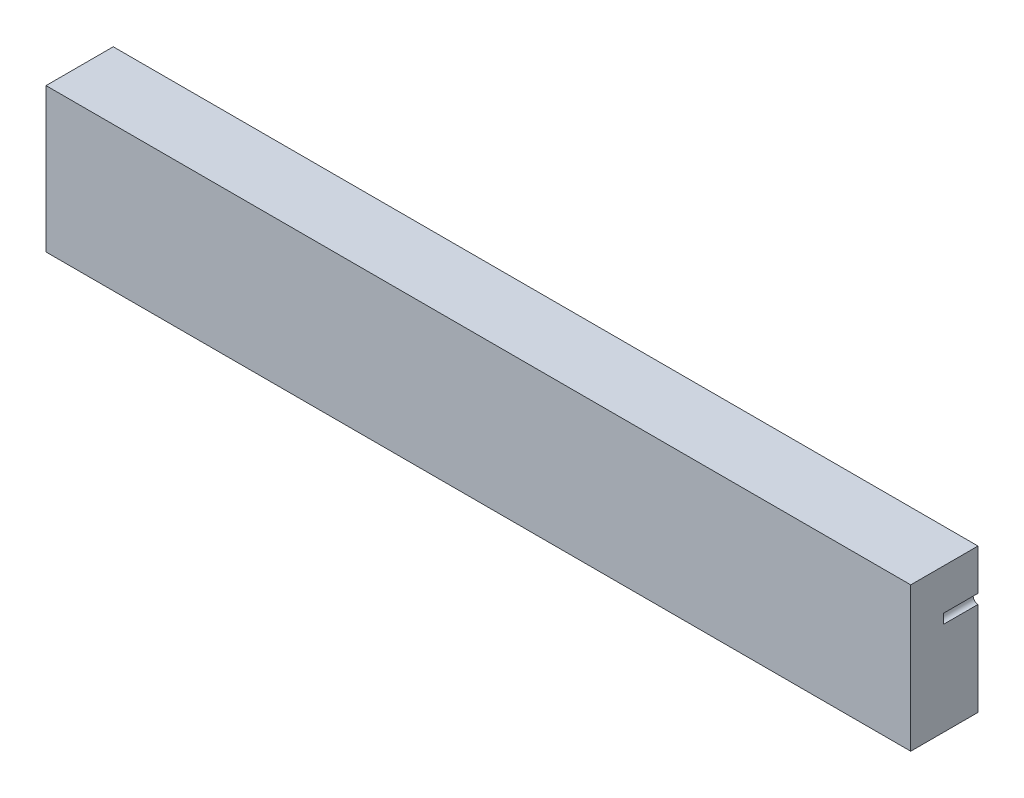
ISO-10303-21;
HEADER;
FILE_DESCRIPTION(('STEP AP214'),'2;1');
FILE_NAME('part.step','',(''),(''),'','','');
FILE_SCHEMA(('AUTOMOTIVE_DESIGN { 1 0 10303 214 1 1 1 1 }'));
ENDSEC;
DATA;
#1=APPLICATION_CONTEXT('core data for automotive mechanical design processes');
#2=APPLICATION_PROTOCOL_DEFINITION('international standard','automotive_design',2000,#1);
#3=PRODUCT_CONTEXT('',#1,'mechanical');
#4=PRODUCT('Part','Part','',(#3));
#5=PRODUCT_RELATED_PRODUCT_CATEGORY('part','',(#4));
#6=PRODUCT_DEFINITION_FORMATION('','',#4);
#7=PRODUCT_DEFINITION_CONTEXT('part definition',#1,'design');
#8=PRODUCT_DEFINITION('design','',#6,#7);
#9=PRODUCT_DEFINITION_SHAPE('','',#8);
#10=(LENGTH_UNIT() NAMED_UNIT(*) SI_UNIT(.MILLI.,.METRE.));
#11=(NAMED_UNIT(*) PLANE_ANGLE_UNIT() SI_UNIT($,.RADIAN.));
#12=(NAMED_UNIT(*) SI_UNIT($,.STERADIAN.) SOLID_ANGLE_UNIT());
#13=UNCERTAINTY_MEASURE_WITH_UNIT(LENGTH_MEASURE(1.E-05),#10,'distance_accuracy_value','');
#14=(GEOMETRIC_REPRESENTATION_CONTEXT(3) GLOBAL_UNCERTAINTY_ASSIGNED_CONTEXT((#13)) GLOBAL_UNIT_ASSIGNED_CONTEXT((#10,
#11,#12)) REPRESENTATION_CONTEXT('',''));
#15=CARTESIAN_POINT('',(0.,0.,0.));
#16=DIRECTION('',(0.,0.,1.));
#17=DIRECTION('',(1.,0.,0.));
#18=AXIS2_PLACEMENT_3D('',#15,#16,#17);
#19=CARTESIAN_POINT('',(285.606602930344,566.490907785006,12.7));
#20=DIRECTION('',(0.,0.,-1.));
#21=DIRECTION('',(-1.,0.,0.));
#22=AXIS2_PLACEMENT_3D('',#19,#20,#21);
#23=PLANE('',#22);
#24=CARTESIAN_POINT('',(285.606602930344,566.490907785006,12.7));
#25=DIRECTION('',(0.,0.,-1.));
#26=DIRECTION('',(-1.,0.,0.));
#27=AXIS2_PLACEMENT_3D('',#24,#25,#26);
#28=CIRCLE('',#27,1.26999999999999);
#29=CARTESIAN_POINT('',(284.336602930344,566.490907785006,12.7));
#30=VERTEX_POINT('',#29);
#31=EDGE_CURVE('E20',#30,#30,#28,.T.);
#32=ORIENTED_EDGE('',*,*,#31,.T.);
#33=EDGE_LOOP('',(#32));
#34=FACE_BOUND('',#33,.T.);
#35=ADVANCED_FACE('F17',(#34),#23,.T.);
#36=CARTESIAN_POINT('',(256.970581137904,566.490907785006,12.7));
#37=DIRECTION('',(0.,0.,1.));
#38=DIRECTION('',(1.,0.,0.));
#39=AXIS2_PLACEMENT_3D('',#36,#37,#38);
#40=PLANE('',#39);
#41=CARTESIAN_POINT('',(256.970581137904,566.490907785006,12.7));
#42=DIRECTION('',(0.,0.,-1.));
#43=DIRECTION('',(-1.,0.,0.));
#44=AXIS2_PLACEMENT_3D('',#41,#42,#43);
#45=CIRCLE('',#44,1.26999999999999);
#46=CARTESIAN_POINT('',(255.700581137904,566.490907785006,12.7));
#47=VERTEX_POINT('',#46);
#48=EDGE_CURVE('E171',#47,#47,#45,.T.);
#49=ORIENTED_EDGE('',*,*,#48,.T.);
#50=EDGE_LOOP('',(#49));
#51=FACE_BOUND('',#50,.T.);
#52=ADVANCED_FACE('F248',(#51),#40,.F.);
#53=CARTESIAN_POINT('',(341.409278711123,566.490907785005,12.7));
#54=DIRECTION('',(0.,0.,-1.));
#55=DIRECTION('',(-1.,0.,0.));
#56=AXIS2_PLACEMENT_3D('',#53,#54,#55);
#57=PLANE('',#56);
#58=CARTESIAN_POINT('',(341.409278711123,566.490907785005,12.7));
#59=DIRECTION('',(0.,0.,-1.));
#60=DIRECTION('',(-1.,0.,0.));
#61=AXIS2_PLACEMENT_3D('',#58,#59,#60);
#62=CIRCLE('',#61,1.26999999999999);
#63=CARTESIAN_POINT('',(340.139278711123,566.490907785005,12.7));
#64=VERTEX_POINT('',#63);
#65=EDGE_CURVE('E169',#64,#64,#62,.T.);
#66=ORIENTED_EDGE('',*,*,#65,.T.);
#67=EDGE_LOOP('',(#66));
#68=FACE_BOUND('',#67,.T.);
#69=ADVANCED_FACE('F245',(#68),#57,.T.);
#70=CARTESIAN_POINT('',(312.773256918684,566.490907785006,12.7));
#71=DIRECTION('',(0.,0.,1.));
#72=DIRECTION('',(1.,0.,0.));
#73=AXIS2_PLACEMENT_3D('',#70,#71,#72);
#74=PLANE('',#73);
#75=CARTESIAN_POINT('',(312.773256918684,566.490907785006,12.7));
#76=DIRECTION('',(0.,0.,-1.));
#77=DIRECTION('',(-1.,0.,0.));
#78=AXIS2_PLACEMENT_3D('',#75,#76,#77);
#79=CIRCLE('',#78,1.26999999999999);
#80=CARTESIAN_POINT('',(311.503256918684,566.490907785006,12.7));
#81=VERTEX_POINT('',#80);
#82=EDGE_CURVE('E166',#81,#81,#79,.T.);
#83=ORIENTED_EDGE('',*,*,#82,.T.);
#84=EDGE_LOOP('',(#83));
#85=FACE_BOUND('',#84,.T.);
#86=ADVANCED_FACE('F247',(#85),#74,.F.);
#87=CARTESIAN_POINT('',(237.255677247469,566.112211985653,12.7));
#88=DIRECTION('',(0.,0.,1.));
#89=DIRECTION('',(1.,0.,0.));
#90=AXIS2_PLACEMENT_3D('',#87,#88,#89);
#91=PLANE('',#90);
#92=CARTESIAN_POINT('',(237.255677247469,566.112211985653,12.7));
#93=DIRECTION('',(0.,0.,-1.));
#94=DIRECTION('',(-1.,0.,0.));
#95=AXIS2_PLACEMENT_3D('',#92,#93,#94);
#96=CIRCLE('',#95,1.26999999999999);
#97=CARTESIAN_POINT('',(235.985677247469,566.112211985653,12.7));
#98=VERTEX_POINT('',#97);
#99=EDGE_CURVE('E163',#98,#98,#96,.T.);
#100=ORIENTED_EDGE('',*,*,#99,.T.);
#101=EDGE_LOOP('',(#100));
#102=FACE_BOUND('',#101,.T.);
#103=ADVANCED_FACE('F193',(#102),#91,.F.);
#104=CARTESIAN_POINT('',(360.901203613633,566.112211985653,12.7));
#105=DIRECTION('',(0.,0.,1.));
#106=DIRECTION('',(1.,0.,0.));
#107=AXIS2_PLACEMENT_3D('',#104,#105,#106);
#108=PLANE('',#107);
#109=CARTESIAN_POINT('',(360.901203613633,566.112211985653,12.7));
#110=DIRECTION('',(0.,0.,-1.));
#111=DIRECTION('',(-1.,0.,0.));
#112=AXIS2_PLACEMENT_3D('',#109,#110,#111);
#113=CIRCLE('',#112,1.26999999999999);
#114=CARTESIAN_POINT('',(359.631203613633,566.112211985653,12.7));
#115=VERTEX_POINT('',#114);
#116=EDGE_CURVE('E79',#115,#115,#113,.T.);
#117=ORIENTED_EDGE('',*,*,#116,.T.);
#118=EDGE_LOOP('',(#117));
#119=FACE_BOUND('',#118,.T.);
#120=ADVANCED_FACE('F182',(#119),#108,.F.);
#121=CARTESIAN_POINT('',(285.606602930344,566.490907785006,12.7));
#122=DIRECTION('',(0.,0.,-1.));
#123=DIRECTION('',(-1.,0.,0.));
#124=AXIS2_PLACEMENT_3D('',#121,#122,#123);
#125=CYLINDRICAL_SURFACE('',#124,1.26999999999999);
#126=CARTESIAN_POINT('',(285.606602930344,566.490907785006,6.096));
#127=DIRECTION('',(0.,0.,-1.));
#128=DIRECTION('',(-1.,0.,0.));
#129=AXIS2_PLACEMENT_3D('',#126,#127,#128);
#130=CIRCLE('',#129,1.26999999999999);
#131=CARTESIAN_POINT('',(284.336602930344,566.490907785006,6.096));
#132=VERTEX_POINT('',#131);
#133=EDGE_CURVE('E78',#132,#132,#130,.T.);
#134=ORIENTED_EDGE('',*,*,#133,.T.);
#135=EDGE_LOOP('',(#134));
#136=FACE_BOUND('',#135,.T.);
#137=ORIENTED_EDGE('',*,*,#31,.F.);
#138=EDGE_LOOP('',(#137));
#139=FACE_BOUND('',#138,.T.);
#140=ADVANCED_FACE('F179',(#136,#139),#125,.F.);
#141=CARTESIAN_POINT('',(256.970581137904,566.490907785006,12.7));
#142=DIRECTION('',(0.,0.,-1.));
#143=DIRECTION('',(-1.,0.,0.));
#144=AXIS2_PLACEMENT_3D('',#141,#142,#143);
#145=CYLINDRICAL_SURFACE('',#144,1.26999999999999);
#146=CARTESIAN_POINT('',(256.970581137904,566.490907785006,6.096));
#147=DIRECTION('',(0.,0.,-1.));
#148=DIRECTION('',(-1.,0.,0.));
#149=AXIS2_PLACEMENT_3D('',#146,#147,#148);
#150=CIRCLE('',#149,1.26999999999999);
#151=CARTESIAN_POINT('',(255.700581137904,566.490907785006,6.096));
#152=VERTEX_POINT('',#151);
#153=EDGE_CURVE('E156',#152,#152,#150,.T.);
#154=ORIENTED_EDGE('',*,*,#153,.T.);
#155=EDGE_LOOP('',(#154));
#156=FACE_BOUND('',#155,.T.);
#157=ORIENTED_EDGE('',*,*,#48,.F.);
#158=EDGE_LOOP('',(#157));
#159=FACE_BOUND('',#158,.T.);
#160=ADVANCED_FACE('F181',(#156,#159),#145,.F.);
#161=CARTESIAN_POINT('',(341.409278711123,566.490907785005,12.7));
#162=DIRECTION('',(0.,0.,-1.));
#163=DIRECTION('',(-1.,0.,0.));
#164=AXIS2_PLACEMENT_3D('',#161,#162,#163);
#165=CYLINDRICAL_SURFACE('',#164,1.26999999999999);
#166=CARTESIAN_POINT('',(341.409278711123,566.490907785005,6.096));
#167=DIRECTION('',(0.,0.,-1.));
#168=DIRECTION('',(-1.,0.,0.));
#169=AXIS2_PLACEMENT_3D('',#166,#167,#168);
#170=CIRCLE('',#169,1.26999999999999);
#171=CARTESIAN_POINT('',(340.139278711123,566.490907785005,6.096));
#172=VERTEX_POINT('',#171);
#173=EDGE_CURVE('E153',#172,#172,#170,.T.);
#174=ORIENTED_EDGE('',*,*,#173,.T.);
#175=EDGE_LOOP('',(#174));
#176=FACE_BOUND('',#175,.T.);
#177=ORIENTED_EDGE('',*,*,#65,.F.);
#178=EDGE_LOOP('',(#177));
#179=FACE_BOUND('',#178,.T.);
#180=ADVANCED_FACE('F190',(#176,#179),#165,.F.);
#181=CARTESIAN_POINT('',(312.773256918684,566.490907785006,12.7));
#182=DIRECTION('',(0.,0.,-1.));
#183=DIRECTION('',(-1.,0.,0.));
#184=AXIS2_PLACEMENT_3D('',#181,#182,#183);
#185=CYLINDRICAL_SURFACE('',#184,1.26999999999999);
#186=CARTESIAN_POINT('',(312.773256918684,566.490907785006,6.096));
#187=DIRECTION('',(0.,0.,-1.));
#188=DIRECTION('',(-1.,0.,0.));
#189=AXIS2_PLACEMENT_3D('',#186,#187,#188);
#190=CIRCLE('',#189,1.26999999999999);
#191=CARTESIAN_POINT('',(311.503256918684,566.490907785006,6.096));
#192=VERTEX_POINT('',#191);
#193=EDGE_CURVE('E150',#192,#192,#190,.T.);
#194=ORIENTED_EDGE('',*,*,#193,.T.);
#195=EDGE_LOOP('',(#194));
#196=FACE_BOUND('',#195,.T.);
#197=ORIENTED_EDGE('',*,*,#82,.F.);
#198=EDGE_LOOP('',(#197));
#199=FACE_BOUND('',#198,.T.);
#200=ADVANCED_FACE('F232',(#196,#199),#185,.F.);
#201=CARTESIAN_POINT('',(237.255677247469,566.112211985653,12.7));
#202=DIRECTION('',(0.,0.,-1.));
#203=DIRECTION('',(-1.,0.,0.));
#204=AXIS2_PLACEMENT_3D('',#201,#202,#203);
#205=CYLINDRICAL_SURFACE('',#204,1.26999999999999);
#206=CARTESIAN_POINT('',(237.255677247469,566.112211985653,6.096));
#207=DIRECTION('',(0.,0.,-1.));
#208=DIRECTION('',(-1.,0.,0.));
#209=AXIS2_PLACEMENT_3D('',#206,#207,#208);
#210=CIRCLE('',#209,1.26999999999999);
#211=CARTESIAN_POINT('',(235.985677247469,566.112211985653,6.096));
#212=VERTEX_POINT('',#211);
#213=EDGE_CURVE('E147',#212,#212,#210,.T.);
#214=ORIENTED_EDGE('',*,*,#213,.T.);
#215=EDGE_LOOP('',(#214));
#216=FACE_BOUND('',#215,.T.);
#217=ORIENTED_EDGE('',*,*,#99,.F.);
#218=EDGE_LOOP('',(#217));
#219=FACE_BOUND('',#218,.T.);
#220=ADVANCED_FACE('F228',(#216,#219),#205,.F.);
#221=CARTESIAN_POINT('',(360.901203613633,566.112211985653,12.7));
#222=DIRECTION('',(0.,0.,-1.));
#223=DIRECTION('',(-1.,0.,0.));
#224=AXIS2_PLACEMENT_3D('',#221,#222,#223);
#225=CYLINDRICAL_SURFACE('',#224,1.26999999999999);
#226=CARTESIAN_POINT('',(360.901203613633,566.112211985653,6.096));
#227=DIRECTION('',(0.,0.,-1.));
#228=DIRECTION('',(-1.,0.,0.));
#229=AXIS2_PLACEMENT_3D('',#226,#227,#228);
#230=CIRCLE('',#229,1.26999999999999);
#231=CARTESIAN_POINT('',(359.631203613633,566.112211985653,6.096));
#232=VERTEX_POINT('',#231);
#233=EDGE_CURVE('E144',#232,#232,#230,.T.);
#234=ORIENTED_EDGE('',*,*,#233,.T.);
#235=EDGE_LOOP('',(#234));
#236=FACE_BOUND('',#235,.T.);
#237=ORIENTED_EDGE('',*,*,#116,.F.);
#238=EDGE_LOOP('',(#237));
#239=FACE_BOUND('',#238,.T.);
#240=ADVANCED_FACE('F225',(#236,#239),#225,.F.);
#241=CARTESIAN_POINT('',(412.03537714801,569.250028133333,15.24));
#242=DIRECTION('',(0.,0.,-1.));
#243=DIRECTION('',(-1.,0.,0.));
#244=AXIS2_PLACEMENT_3D('',#241,#242,#243);
#245=PLANE('',#244);
#246=CARTESIAN_POINT('',(412.03537714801,569.250028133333,15.24));
#247=DIRECTION('',(0.,0.,-1.));
#248=DIRECTION('',(-1.,0.,0.));
#249=AXIS2_PLACEMENT_3D('',#246,#247,#248);
#250=CIRCLE('',#249,1.26999999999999);
#251=CARTESIAN_POINT('',(412.03537714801,567.980028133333,15.24));
#252=VERTEX_POINT('',#251);
#253=CARTESIAN_POINT('',(412.03537714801,570.520028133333,15.24));
#254=VERTEX_POINT('',#253);
#255=EDGE_CURVE('E67',#252,#254,#250,.T.);
#256=ORIENTED_EDGE('',*,*,#255,.T.);
#257=DIRECTION('',(0.,1.,0.));
#258=VECTOR('',#257,1.);
#259=CARTESIAN_POINT('',(412.03537714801,0.,15.24));
#260=LINE('',#259,#258);
#261=EDGE_CURVE('E81',#252,#254,#260,.T.);
#262=ORIENTED_EDGE('',*,*,#261,.F.);
#263=EDGE_LOOP('',(#256,#262));
#264=FACE_BOUND('',#263,.T.);
#265=ADVANCED_FACE('F82',(#264),#245,.T.);
#266=CARTESIAN_POINT('',(412.03537714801,569.250028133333,15.24));
#267=DIRECTION('',(0.,0.,-1.));
#268=DIRECTION('',(-1.,0.,0.));
#269=AXIS2_PLACEMENT_3D('',#266,#267,#268);
#270=CYLINDRICAL_SURFACE('',#269,1.26999999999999);
#271=ORIENTED_EDGE('',*,*,#255,.F.);
#272=DIRECTION('',(0.,0.,-1.));
#273=VECTOR('',#272,1.);
#274=CARTESIAN_POINT('',(412.03537714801,567.980028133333,23.876));
#275=LINE('',#274,#273);
#276=CARTESIAN_POINT('',(412.03537714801,567.980028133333,6.096));
#277=VERTEX_POINT('',#276);
#278=EDGE_CURVE('E73',#277,#252,#275,.F.);
#279=ORIENTED_EDGE('',*,*,#278,.F.);
#280=CARTESIAN_POINT('',(412.03537714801,569.250028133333,6.096));
#281=DIRECTION('',(0.,0.,-1.));
#282=DIRECTION('',(-1.,0.,0.));
#283=AXIS2_PLACEMENT_3D('',#280,#281,#282);
#284=CIRCLE('',#283,1.26999999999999);
#285=CARTESIAN_POINT('',(412.03537714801,570.520028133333,6.096));
#286=VERTEX_POINT('',#285);
#287=EDGE_CURVE('E132',#277,#286,#284,.T.);
#288=ORIENTED_EDGE('',*,*,#287,.T.);
#289=DIRECTION('',(0.,0.,-1.));
#290=VECTOR('',#289,1.);
#291=CARTESIAN_POINT('',(412.03537714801,570.520028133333,23.876));
#292=LINE('',#291,#290);
#293=EDGE_CURVE('E76',#254,#286,#292,.T.);
#294=ORIENTED_EDGE('',*,*,#293,.F.);
#295=EDGE_LOOP('',(#271,#279,#288,#294));
#296=FACE_BOUND('',#295,.T.);
#297=ADVANCED_FACE('F71',(#296),#270,.F.);
#298=CARTESIAN_POINT('',(0.,0.,6.096));
#299=DIRECTION('',(0.,0.,1.));
#300=DIRECTION('',(1.,0.,0.));
#301=AXIS2_PLACEMENT_3D('',#298,#299,#300);
#302=PLANE('',#301);
#303=ORIENTED_EDGE('',*,*,#287,.F.);
#304=DIRECTION('',(0.,1.,0.));
#305=VECTOR('',#304,1.);
#306=CARTESIAN_POINT('',(412.03537714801,0.,6.096));
#307=LINE('',#306,#305);
#308=CARTESIAN_POINT('',(412.03537714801,543.252211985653,6.096));
#309=VERTEX_POINT('',#308);
#310=EDGE_CURVE('E87',#309,#277,#307,.T.);
#311=ORIENTED_EDGE('',*,*,#310,.F.);
#312=DIRECTION('',(1.,0.,0.));
#313=VECTOR('',#312,1.);
#314=CARTESIAN_POINT('',(0.,543.252211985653,6.096));
#315=LINE('',#314,#313);
#316=CARTESIAN_POINT('',(183.43537714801,543.252211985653,6.096));
#317=VERTEX_POINT('',#316);
#318=EDGE_CURVE('E88',#309,#317,#315,.F.);
#319=ORIENTED_EDGE('',*,*,#318,.T.);
#320=DIRECTION('',(0.,1.,0.));
#321=VECTOR('',#320,1.);
#322=CARTESIAN_POINT('',(183.435377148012,7.10238699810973E-13,6.096));
#323=LINE('',#322,#321);
#324=CARTESIAN_POINT('',(183.43537714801,581.352211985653,6.096));
#325=VERTEX_POINT('',#324);
#326=EDGE_CURVE('E128',#317,#325,#323,.T.);
#327=ORIENTED_EDGE('',*,*,#326,.T.);
#328=DIRECTION('',(1.,0.,0.));
#329=VECTOR('',#328,1.);
#330=CARTESIAN_POINT('',(0.,581.352211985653,6.096));
#331=LINE('',#330,#329);
#332=CARTESIAN_POINT('',(412.03537714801,581.352211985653,6.096));
#333=VERTEX_POINT('',#332);
#334=EDGE_CURVE('E118',#325,#333,#331,.T.);
#335=ORIENTED_EDGE('',*,*,#334,.T.);
#336=DIRECTION('',(0.,1.,0.));
#337=VECTOR('',#336,1.);
#338=CARTESIAN_POINT('',(412.03537714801,0.,6.096));
#339=LINE('',#338,#337);
#340=EDGE_CURVE('E99',#286,#333,#339,.T.);
#341=ORIENTED_EDGE('',*,*,#340,.F.);
#342=EDGE_LOOP('',(#303,#311,#319,#327,#335,#341));
#343=FACE_BOUND('',#342,.T.);
#344=ORIENTED_EDGE('',*,*,#233,.F.);
#345=EDGE_LOOP('',(#344));
#346=FACE_BOUND('',#345,.T.);
#347=ORIENTED_EDGE('',*,*,#213,.F.);
#348=EDGE_LOOP('',(#347));
#349=FACE_BOUND('',#348,.T.);
#350=ORIENTED_EDGE('',*,*,#193,.F.);
#351=EDGE_LOOP('',(#350));
#352=FACE_BOUND('',#351,.T.);
#353=ORIENTED_EDGE('',*,*,#173,.F.);
#354=EDGE_LOOP('',(#353));
#355=FACE_BOUND('',#354,.T.);
#356=ORIENTED_EDGE('',*,*,#153,.F.);
#357=EDGE_LOOP('',(#356));
#358=FACE_BOUND('',#357,.T.);
#359=ORIENTED_EDGE('',*,*,#133,.F.);
#360=EDGE_LOOP('',(#359));
#361=FACE_BOUND('',#360,.T.);
#362=ADVANCED_FACE('F216',(#343,#346,#349,#352,#355,#358,#361),#302,.F.);
#363=CARTESIAN_POINT('',(183.435377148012,7.10238699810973E-13,23.876));
#364=DIRECTION('',(1.,0.,0.));
#365=DIRECTION('',(0.,1.,0.));
#366=AXIS2_PLACEMENT_3D('',#363,#364,#365);
#367=PLANE('',#366);
#368=DIRECTION('',(0.,0.,1.));
#369=VECTOR('',#368,1.);
#370=CARTESIAN_POINT('',(183.43537714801,543.252211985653,23.876));
#371=LINE('',#370,#369);
#372=CARTESIAN_POINT('',(183.43537714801,543.252211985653,23.876));
#373=VERTEX_POINT('',#372);
#374=EDGE_CURVE('E91',#317,#373,#371,.T.);
#375=ORIENTED_EDGE('',*,*,#374,.T.);
#376=DIRECTION('',(0.,1.,0.));
#377=VECTOR('',#376,1.);
#378=CARTESIAN_POINT('',(183.43537714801,0.,23.876));
#379=LINE('',#378,#377);
#380=CARTESIAN_POINT('',(183.43537714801,581.352211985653,23.876));
#381=VERTEX_POINT('',#380);
#382=EDGE_CURVE('E111',#381,#373,#379,.F.);
#383=ORIENTED_EDGE('',*,*,#382,.F.);
#384=DIRECTION('',(0.,0.,-1.));
#385=VECTOR('',#384,1.);
#386=CARTESIAN_POINT('',(183.43537714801,581.352211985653,23.876));
#387=LINE('',#386,#385);
#388=EDGE_CURVE('E121',#381,#325,#387,.T.);
#389=ORIENTED_EDGE('',*,*,#388,.T.);
#390=ORIENTED_EDGE('',*,*,#326,.F.);
#391=EDGE_LOOP('',(#375,#383,#389,#390));
#392=FACE_BOUND('',#391,.T.);
#393=ADVANCED_FACE('F212',(#392),#367,.F.);
#394=CARTESIAN_POINT('',(0.,543.252211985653,23.876));
#395=DIRECTION('',(0.,1.,0.));
#396=DIRECTION('',(0.,0.,1.));
#397=AXIS2_PLACEMENT_3D('',#394,#395,#396);
#398=PLANE('',#397);
#399=DIRECTION('',(0.,0.,-1.));
#400=VECTOR('',#399,1.);
#401=CARTESIAN_POINT('',(412.03537714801,543.252211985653,23.876));
#402=LINE('',#401,#400);
#403=CARTESIAN_POINT('',(412.03537714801,543.252211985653,23.876));
#404=VERTEX_POINT('',#403);
#405=EDGE_CURVE('E95',#404,#309,#402,.T.);
#406=ORIENTED_EDGE('',*,*,#405,.F.);
#407=DIRECTION('',(1.,0.,0.));
#408=VECTOR('',#407,1.);
#409=CARTESIAN_POINT('',(0.,543.252211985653,23.876));
#410=LINE('',#409,#408);
#411=EDGE_CURVE('E106',#373,#404,#410,.T.);
#412=ORIENTED_EDGE('',*,*,#411,.F.);
#413=ORIENTED_EDGE('',*,*,#374,.F.);
#414=ORIENTED_EDGE('',*,*,#318,.F.);
#415=EDGE_LOOP('',(#406,#412,#413,#414));
#416=FACE_BOUND('',#415,.T.);
#417=ADVANCED_FACE('F209',(#416),#398,.F.);
#418=CARTESIAN_POINT('',(412.03537714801,0.,23.876));
#419=DIRECTION('',(1.,0.,0.));
#420=DIRECTION('',(0.,0.,-1.));
#421=AXIS2_PLACEMENT_3D('',#418,#419,#420);
#422=PLANE('',#421);
#423=ORIENTED_EDGE('',*,*,#405,.T.);
#424=ORIENTED_EDGE('',*,*,#310,.T.);
#425=ORIENTED_EDGE('',*,*,#278,.T.);
#426=ORIENTED_EDGE('',*,*,#261,.T.);
#427=ORIENTED_EDGE('',*,*,#293,.T.);
#428=ORIENTED_EDGE('',*,*,#340,.T.);
#429=DIRECTION('',(0.,0.,-1.));
#430=VECTOR('',#429,1.);
#431=CARTESIAN_POINT('',(412.03537714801,581.352211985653,23.876));
#432=LINE('',#431,#430);
#433=CARTESIAN_POINT('',(412.03537714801,581.352211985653,23.876));
#434=VERTEX_POINT('',#433);
#435=EDGE_CURVE('E35',#333,#434,#432,.F.);
#436=ORIENTED_EDGE('',*,*,#435,.T.);
#437=DIRECTION('',(0.,1.,0.));
#438=VECTOR('',#437,1.);
#439=CARTESIAN_POINT('',(412.03537714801,0.,23.876));
#440=LINE('',#439,#438);
#441=EDGE_CURVE('E26',#404,#434,#440,.T.);
#442=ORIENTED_EDGE('',*,*,#441,.F.);
#443=EDGE_LOOP('',(#423,#424,#425,#426,#427,#428,#436,#442));
#444=FACE_BOUND('',#443,.T.);
#445=ADVANCED_FACE('F85',(#444),#422,.T.);
#446=CARTESIAN_POINT('',(0.,581.352211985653,23.876));
#447=DIRECTION('',(0.,-1.,0.));
#448=DIRECTION('',(0.,0.,-1.));
#449=AXIS2_PLACEMENT_3D('',#446,#447,#448);
#450=PLANE('',#449);
#451=ORIENTED_EDGE('',*,*,#388,.F.);
#452=DIRECTION('',(1.,0.,0.));
#453=VECTOR('',#452,1.);
#454=CARTESIAN_POINT('',(0.,581.352211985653,23.876));
#455=LINE('',#454,#453);
#456=EDGE_CURVE('E11',#434,#381,#455,.F.);
#457=ORIENTED_EDGE('',*,*,#456,.F.);
#458=ORIENTED_EDGE('',*,*,#435,.F.);
#459=ORIENTED_EDGE('',*,*,#334,.F.);
#460=EDGE_LOOP('',(#451,#457,#458,#459));
#461=FACE_BOUND('',#460,.T.);
#462=ADVANCED_FACE('F198',(#461),#450,.F.);
#463=CARTESIAN_POINT('',(0.,0.,23.876));
#464=DIRECTION('',(0.,0.,1.));
#465=DIRECTION('',(1.,0.,0.));
#466=AXIS2_PLACEMENT_3D('',#463,#464,#465);
#467=PLANE('',#466);
#468=ORIENTED_EDGE('',*,*,#441,.T.);
#469=ORIENTED_EDGE('',*,*,#456,.T.);
#470=ORIENTED_EDGE('',*,*,#382,.T.);
#471=ORIENTED_EDGE('',*,*,#411,.T.);
#472=EDGE_LOOP('',(#468,#469,#470,#471));
#473=FACE_BOUND('',#472,.T.);
#474=ADVANCED_FACE('F196',(#473),#467,.T.);
#475=CLOSED_SHELL('',(#35,#52,#69,#86,#103,#120,#140,#160,#180,#200,#220,#240,#265,#297,#362,
#393,#417,#445,#462,#474));
#476=MANIFOLD_SOLID_BREP('B1',#475);
#477=ADVANCED_BREP_SHAPE_REPRESENTATION('',(#18,#476),#14);
#478=SHAPE_DEFINITION_REPRESENTATION(#9,#477);
ENDSEC;
END-ISO-10303-21;
